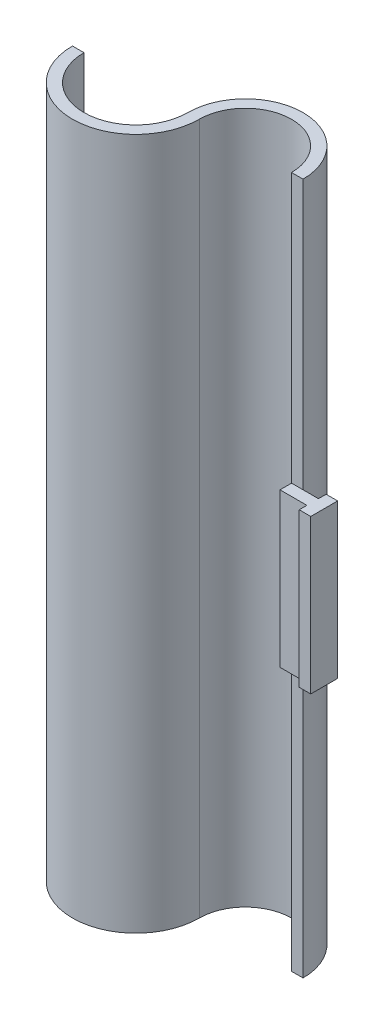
from build123d import *

# Parameters (mm, degrees)
BOSS_EXTRUDE1_DEPTH = 180
BOSS_EXTRUDE2_DEPTH = 20


with BuildPart() as part:
    # Sketch11 → Boss-Extrude1 (new body)
    with BuildSketch(Plane(origin=(0, 0, 0), x_dir=(1, 0, 0), z_dir=(0, 1, 0))):
        with BuildLine():
            Line((-60, 0), (-57, 0))
            ThreePointArc((-57, 0), (-43.5, -13.5), (-30, 0))
            ThreePointArc((-30, 0), (-15, 15), (0, 0))
            Line((0, 0), (-3, 0))
            ThreePointArc((-3, 0), (-15, 12), (-27, 0))
            ThreePointArc((-27, 0), (-43.5, -16.5), (-60, 0))
        make_face()
    extrude(amount=BOSS_EXTRUDE1_DEPTH)

    # Sketch14 → Boss-Extrude2 (add, symmetric)
    with BuildSketch(Plane(origin=(0, 90, 0), x_dir=(1, 0, 0), z_dir=(0, 1, 0))):
        Polygon((4, 2), (4, 0), (-3, 0), (-3, -3), (4, -3), (4, -5), (7, -5), (7, 2), align=None)
    extrude(amount=BOSS_EXTRUDE2_DEPTH, both=True)


solid = part.part
